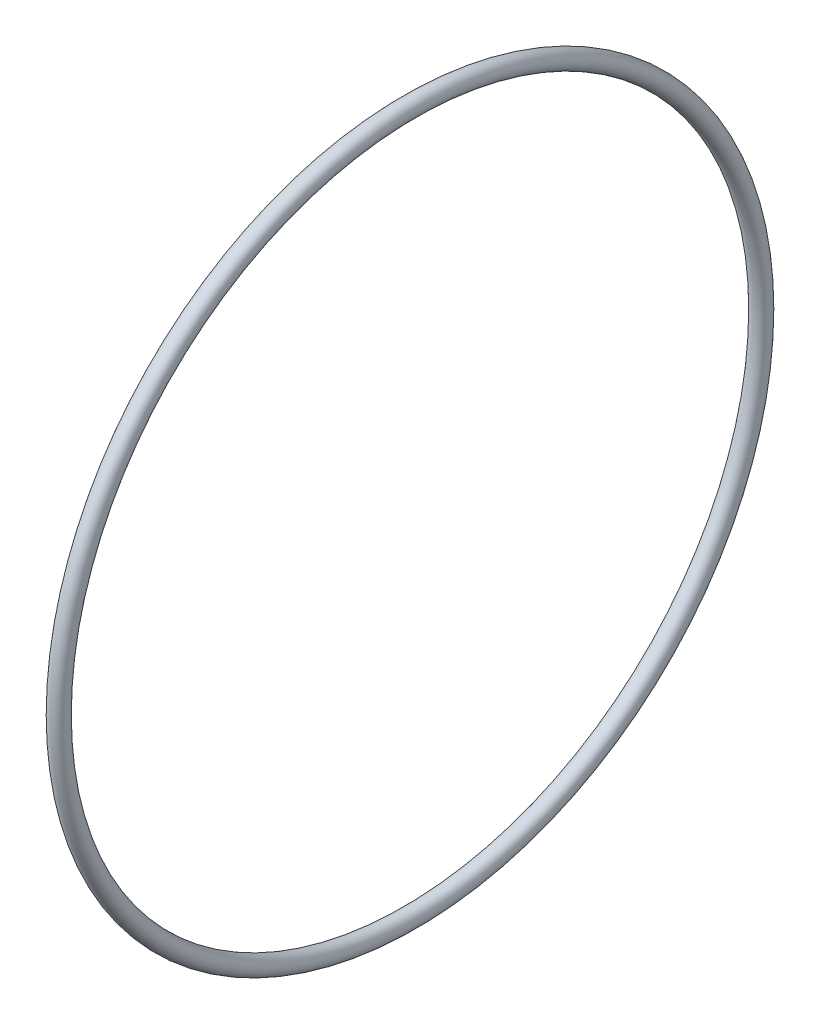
ISO-10303-21;
HEADER;
FILE_DESCRIPTION(('STEP AP214'),'2;1');
FILE_NAME('part.step','',(''),(''),'','','');
FILE_SCHEMA(('AUTOMOTIVE_DESIGN { 1 0 10303 214 1 1 1 1 }'));
ENDSEC;
DATA;
#1=APPLICATION_CONTEXT('core data for automotive mechanical design processes');
#2=APPLICATION_PROTOCOL_DEFINITION('international standard','automotive_design',2000,#1);
#3=PRODUCT_CONTEXT('',#1,'mechanical');
#4=PRODUCT('Part','Part','',(#3));
#5=PRODUCT_RELATED_PRODUCT_CATEGORY('part','',(#4));
#6=PRODUCT_DEFINITION_FORMATION('','',#4);
#7=PRODUCT_DEFINITION_CONTEXT('part definition',#1,'design');
#8=PRODUCT_DEFINITION('design','',#6,#7);
#9=PRODUCT_DEFINITION_SHAPE('','',#8);
#10=(LENGTH_UNIT() NAMED_UNIT(*) SI_UNIT(.MILLI.,.METRE.));
#11=(NAMED_UNIT(*) PLANE_ANGLE_UNIT() SI_UNIT($,.RADIAN.));
#12=(NAMED_UNIT(*) SI_UNIT($,.STERADIAN.) SOLID_ANGLE_UNIT());
#13=UNCERTAINTY_MEASURE_WITH_UNIT(LENGTH_MEASURE(1.E-05),#10,'distance_accuracy_value','');
#14=(GEOMETRIC_REPRESENTATION_CONTEXT(3) GLOBAL_UNCERTAINTY_ASSIGNED_CONTEXT((#13)) GLOBAL_UNIT_ASSIGNED_CONTEXT((#10,
#11,#12)) REPRESENTATION_CONTEXT('',''));
#15=CARTESIAN_POINT('',(0.,0.,0.));
#16=DIRECTION('',(0.,0.,1.));
#17=DIRECTION('',(1.,0.,0.));
#18=AXIS2_PLACEMENT_3D('',#15,#16,#17);
#19=CARTESIAN_POINT('',(0.,0.,0.));
#20=DIRECTION('',(-1.,0.,0.));
#21=DIRECTION('',(0.,0.,1.));
#22=AXIS2_PLACEMENT_3D('',#19,#20,#21);
#23=TOROIDAL_SURFACE('',#22,69.8246,1.7653);
#24=CARTESIAN_POINT('',(0.,0.,71.5899));
#25=VERTEX_POINT('',#24);
#26=VERTEX_LOOP('',#25);
#27=FACE_BOUND('',#26,.T.);
#28=ADVANCED_FACE('F33',(#27),#23,.T.);
#29=CLOSED_SHELL('',(#28));
#30=MANIFOLD_SOLID_BREP('B2',#29);
#31=ADVANCED_BREP_SHAPE_REPRESENTATION('',(#18,#30),#14);
#32=SHAPE_DEFINITION_REPRESENTATION(#9,#31);
ENDSEC;
END-ISO-10303-21;
